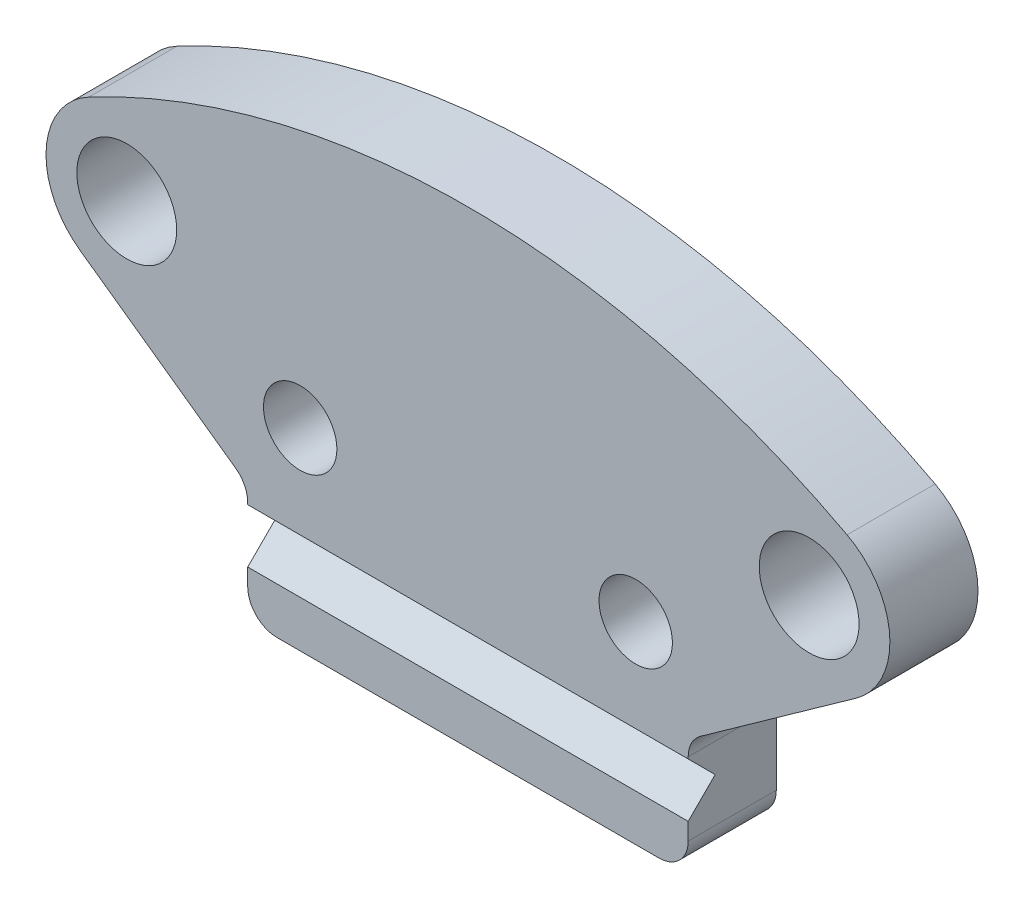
from build123d import *

# Parameters (mm, degrees)
ESQUISSE1_R                  = 1.7
BOSS_EXTRU_1_DEPTH           = 3
TROU_TARAUD_M31_D            = 2.5
ENL_V_MAT_EXTRU_1_DEPTH      = 38.476078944
ENL_V_MAT_EXTRU_1_DEPTH_BACK = 38.476078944
CONG_1_R                     = 2
ENL_V_MAT_EXTRU_2_DEPTH      = 32.416438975
ENL_V_MAT_EXTRU_2_DEPTH_BACK = 32.416438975
CONG_2_R                     = 1


with BuildPart() as part:
    # Esquisse1 → Boss.-Extru.1 (new body)
    with BuildSketch(Plane.XY):
        with BuildLine():
            Line((9.5902558, 14.044994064), (15.637784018, 22.681759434))
            ThreePointArc((15.637784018, 22.681759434), (0, 27.55), (-15.637784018, 22.681759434))
            Line((-15.637784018, 22.681759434), (-9.5902558, 14.044994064))
            Line((-9.5902558, 14.044994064), (-9.5902558, 11.544994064))
            Line((-9.5902558, 11.544994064), (9.5902558, 11.544994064))
            Line((9.5902558, 11.544994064), (9.5902558, 14.044994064))
        make_face()
        with Locations((11.619421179, 21.852952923)):
            Circle(ESQUISSE1_R, mode=Mode.SUBTRACT)
        with Locations((-11.619421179, 21.852952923)):
            Circle(ESQUISSE1_R, mode=Mode.SUBTRACT)
    extrude(amount=BOSS_EXTRU_1_DEPTH)

    # Trou taraud_ M31 (through all)
    with Locations(Plane.XY.offset(3)):
        with Locations((5.713410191, 18.120622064), (-5.713410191, 18.120622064)):
            Hole(TROU_TARAUD_M31_D / 2)

    # Esquisse4 → Enl_v. mat.-Extru.1 (cut, two sides: drawn at the far end of the back side and taken through both)
    with BuildSketch(Plane.ZY.offset(9.5902558).offset(-ENL_V_MAT_EXTRU_1_DEPTH_BACK)):
        Polygon((3, 14.964232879), (2.080761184, 14.044994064), (3, 13.125755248), align=None)
    extrude(amount=ENL_V_MAT_EXTRU_1_DEPTH + ENL_V_MAT_EXTRU_1_DEPTH_BACK, mode=Mode.SUBTRACT)

    # Cong_1
    cong_1_edges = [part.edges().sort_by_distance(p)[0] for p in [
        (-15.637784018, 22.681759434, 1.5),
        (15.637784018, 22.681759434, 1.5),
    ]]
    fillet(cong_1_edges, radius=CONG_1_R)

    # Esquisse5 → Enl_v. mat.-Extru.2 (cut, two sides: drawn at the far end of the back side and taken through both)
    with BuildSketch(Plane.XY.offset(3).offset(-ENL_V_MAT_EXTRU_2_DEPTH_BACK)):
        with BuildLine():
            Line((-13.214198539, 19.612599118), (-7.5, 15.544994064))
            Line((-7.5, 15.544994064), (-7.5, 11.544994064))
            Line((-7.5, 11.544994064), (-25.014308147, 11.544994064))
            ThreePointArc((-25.014308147, 11.544994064), (0, 27.55), (25.014308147, 11.544994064))
            Line((25.014308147, 11.544994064), (7.5, 11.544994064))
            Line((7.5, 11.544994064), (7.5, 15.544994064))
            Line((7.5, 15.544994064), (13.214198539, 19.612599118))
            ThreePointArc((13.214198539, 19.612599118), (14.363619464, 22.031490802), (12.910467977, 24.281058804))
            ThreePointArc((12.910467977, 24.281058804), (0, 27.5), (-12.910467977, 24.281058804))
            ThreePointArc((-12.910467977, 24.281058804), (-14.363619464, 22.031490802), (-13.214198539, 19.612599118))
        make_face()
    extrude(amount=ENL_V_MAT_EXTRU_2_DEPTH + ENL_V_MAT_EXTRU_2_DEPTH_BACK, mode=Mode.SUBTRACT)

    # Cong_2
    cong_2_edges = [part.edges().sort_by_distance(p)[0] for p in [
        (7.5, 15.544994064, 1.5),
        (7.5, 11.544994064, 1.5),
        (-7.5, 11.544994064, 1.5),
        (-7.5, 15.544994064, 1.5),
    ]]
    fillet(cong_2_edges, radius=CONG_2_R)


solid = part.part
